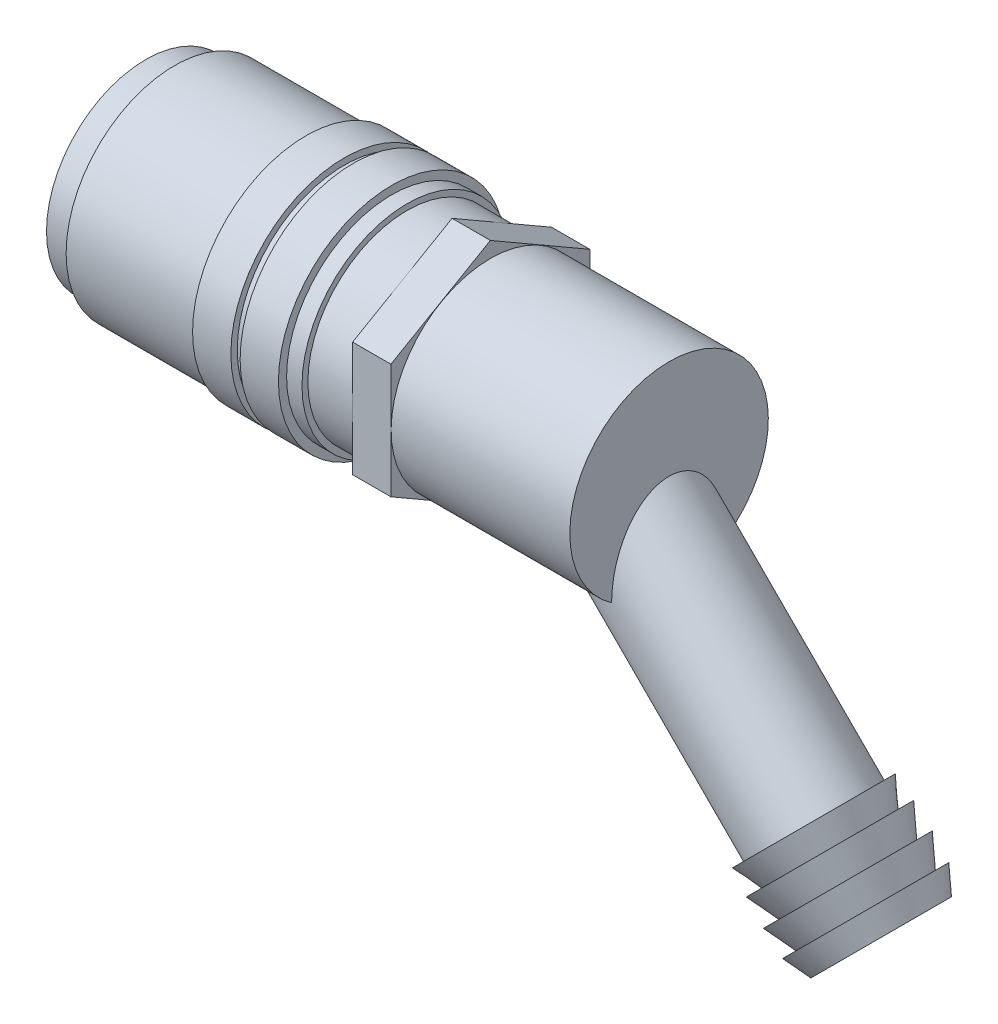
ISO-10303-21;
HEADER;
FILE_DESCRIPTION(('STEP AP214'),'2;1');
FILE_NAME('part.step','',(''),(''),'','','');
FILE_SCHEMA(('AUTOMOTIVE_DESIGN { 1 0 10303 214 1 1 1 1 }'));
ENDSEC;
DATA;
#1=APPLICATION_CONTEXT('core data for automotive mechanical design processes');
#2=APPLICATION_PROTOCOL_DEFINITION('international standard','automotive_design',2000,#1);
#3=PRODUCT_CONTEXT('',#1,'mechanical');
#4=PRODUCT('Part','Part','',(#3));
#5=PRODUCT_RELATED_PRODUCT_CATEGORY('part','',(#4));
#6=PRODUCT_DEFINITION_FORMATION('','',#4);
#7=PRODUCT_DEFINITION_CONTEXT('part definition',#1,'design');
#8=PRODUCT_DEFINITION('design','',#6,#7);
#9=PRODUCT_DEFINITION_SHAPE('','',#8);
#10=(LENGTH_UNIT() NAMED_UNIT(*) SI_UNIT(.MILLI.,.METRE.));
#11=(NAMED_UNIT(*) PLANE_ANGLE_UNIT() SI_UNIT($,.RADIAN.));
#12=(NAMED_UNIT(*) SI_UNIT($,.STERADIAN.) SOLID_ANGLE_UNIT());
#13=UNCERTAINTY_MEASURE_WITH_UNIT(LENGTH_MEASURE(1.E-05),#10,'distance_accuracy_value','');
#14=(GEOMETRIC_REPRESENTATION_CONTEXT(3) GLOBAL_UNCERTAINTY_ASSIGNED_CONTEXT((#13)) GLOBAL_UNIT_ASSIGNED_CONTEXT((#10,
#11,#12)) REPRESENTATION_CONTEXT('',''));
#15=CARTESIAN_POINT('',(0.,0.,0.));
#16=DIRECTION('',(0.,0.,1.));
#17=DIRECTION('',(1.,0.,0.));
#18=AXIS2_PLACEMENT_3D('',#15,#16,#17);
#19=CARTESIAN_POINT('',(41.,0.,0.));
#20=DIRECTION('',(-1.,0.,0.));
#21=DIRECTION('',(0.,0.,1.));
#22=AXIS2_PLACEMENT_3D('',#19,#20,#21);
#23=CYLINDRICAL_SURFACE('',#22,7.77632073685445);
#24=CARTESIAN_POINT('',(27.,0.,0.));
#25=DIRECTION('',(1.,0.,0.));
#26=DIRECTION('',(0.,0.,-1.));
#27=AXIS2_PLACEMENT_3D('',#24,#25,#26);
#28=CIRCLE('',#27,7.77632073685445);
#29=CARTESIAN_POINT('',(27.,0.,-7.77632073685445));
#30=VERTEX_POINT('',#29);
#31=EDGE_CURVE('E94',#30,#30,#28,.T.);
#32=ORIENTED_EDGE('',*,*,#31,.T.);
#33=EDGE_LOOP('',(#32));
#34=FACE_BOUND('',#33,.T.);
#35=CARTESIAN_POINT('',(41.,-6.34203473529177,4.49997329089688));
#36=CARTESIAN_POINT('',(40.8430959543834,-6.34174600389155,4.50032956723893));
#37=CARTESIAN_POINT('',(40.6860777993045,-6.34438767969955,4.49665247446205));
#38=CARTESIAN_POINT('',(40.3724233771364,-6.3561010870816,4.48010877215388));
#39=CARTESIAN_POINT('',(40.2157887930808,-6.36518744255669,4.46722126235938));
#40=CARTESIAN_POINT('',(39.9030597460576,-6.39046083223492,4.43098605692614));
#41=CARTESIAN_POINT('',(39.7469782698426,-6.40670091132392,4.40756019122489));
#42=CARTESIAN_POINT('',(39.4380870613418,-6.44660150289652,4.34899585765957));
#43=CARTESIAN_POINT('',(39.285274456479,-6.47025518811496,4.31386816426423));
#44=CARTESIAN_POINT('',(39.0193339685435,-6.51858889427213,4.24035470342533));
#45=CARTESIAN_POINT('',(38.9052021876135,-6.54176615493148,4.20460169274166));
#46=CARTESIAN_POINT('',(38.6806909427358,-6.59222412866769,4.12504151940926));
#47=CARTESIAN_POINT('',(38.5703115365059,-6.61950490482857,4.08123423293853));
#48=CARTESIAN_POINT('',(38.3546438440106,-6.67761478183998,3.98544196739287));
#49=CARTESIAN_POINT('',(38.2493380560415,-6.70843022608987,3.93348819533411));
#50=CARTESIAN_POINT('',(38.0442769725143,-6.77303928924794,3.82116437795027));
#51=CARTESIAN_POINT('',(37.9445212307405,-6.80683266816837,3.76079501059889));
#52=CARTESIAN_POINT('',(37.7509345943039,-6.87672556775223,3.6314232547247));
#53=CARTESIAN_POINT('',(37.6571317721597,-6.91283460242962,3.56238396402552));
#54=CARTESIAN_POINT('',(37.476616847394,-6.9862558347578,3.41615039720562));
#55=CARTESIAN_POINT('',(37.3899049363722,-7.02356806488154,3.33895590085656));
#56=CARTESIAN_POINT('',(37.2239843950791,-7.09841286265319,3.17674141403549));
#57=CARTESIAN_POINT('',(37.1447864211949,-7.1359456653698,3.09171063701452));
#58=CARTESIAN_POINT('',(36.9943993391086,-7.21013965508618,2.91449388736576));
#59=CARTESIAN_POINT('',(36.9232100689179,-7.24680085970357,2.82230805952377));
#60=CARTESIAN_POINT('',(36.7922511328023,-7.31656745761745,2.63598685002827));
#61=CARTESIAN_POINT('',(36.7321000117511,-7.3497590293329,2.54215125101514));
#62=CARTESIAN_POINT('',(36.6193554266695,-7.41368584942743,2.34920358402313));
#63=CARTESIAN_POINT('',(36.5667645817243,-7.44442024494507,2.25008970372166));
#64=CARTESIAN_POINT('',(36.4692389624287,-7.50270931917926,2.04734844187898));
#65=CARTESIAN_POINT('',(36.4242995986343,-7.5302659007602,1.94372381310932));
#66=CARTESIAN_POINT('',(36.3420258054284,-7.58163734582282,1.73255651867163));
#67=CARTESIAN_POINT('',(36.3046942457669,-7.60545079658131,1.62501239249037));
#68=CARTESIAN_POINT('',(36.2363495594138,-7.64966458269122,1.40254928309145));
#69=CARTESIAN_POINT('',(36.20563417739,-7.66989870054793,1.28750569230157));
#70=CARTESIAN_POINT('',(36.1523663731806,-7.70535823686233,1.0547434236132));
#71=CARTESIAN_POINT('',(36.1298169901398,-7.7205817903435,0.937023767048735));
#72=CARTESIAN_POINT('',(36.0928699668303,-7.74569005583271,0.699769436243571));
#73=CARTESIAN_POINT('',(36.0784710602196,-7.7555755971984,0.580235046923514));
#74=CARTESIAN_POINT('',(36.057794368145,-7.7698115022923,0.340097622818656));
#75=CARTESIAN_POINT('',(36.0515194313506,-7.77415992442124,0.219494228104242));
#76=CARTESIAN_POINT('',(36.0470312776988,-7.77726735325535,-0.0251322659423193));
#77=CARTESIAN_POINT('',(36.0490359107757,-7.77587532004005,-0.14916136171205));
#78=CARTESIAN_POINT('',(36.0616049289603,-7.76718826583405,-0.396577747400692));
#79=CARTESIAN_POINT('',(36.0721693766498,-7.75989320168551,-0.519965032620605));
#80=CARTESIAN_POINT('',(36.1018790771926,-7.73955414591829,-0.765254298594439));
#81=CARTESIAN_POINT('',(36.1210263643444,-7.726508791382,-0.887155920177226));
#82=CARTESIAN_POINT('',(36.1679224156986,-7.69495903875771,-1.12852926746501));
#83=CARTESIAN_POINT('',(36.1956680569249,-7.67645662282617,-1.24800185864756));
#84=CARTESIAN_POINT('',(36.2598771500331,-7.63435201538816,-1.48399296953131));
#85=CARTESIAN_POINT('',(36.2963622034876,-7.61073720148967,-1.60050336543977));
#86=CARTESIAN_POINT('',(36.3780261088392,-7.55899446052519,-1.8293505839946));
#87=CARTESIAN_POINT('',(36.4232015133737,-7.53086832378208,-1.94168904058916));
#88=CARTESIAN_POINT('',(36.5222899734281,-7.47076157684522,-2.16145087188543));
#89=CARTESIAN_POINT('',(36.5762077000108,-7.43877890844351,-2.26887157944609));
#90=CARTESIAN_POINT('',(36.6927030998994,-7.37179792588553,-2.47786104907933));
#91=CARTESIAN_POINT('',(36.7552770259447,-7.33680091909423,-2.57943231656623));
#92=CARTESIAN_POINT('',(36.8875626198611,-7.2654820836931,-2.77388374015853));
#93=CARTESIAN_POINT('',(36.9570934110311,-7.22920448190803,-2.866903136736));
#94=CARTESIAN_POINT('',(37.1041245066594,-7.1556232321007,-3.04591247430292));
#95=CARTESIAN_POINT('',(37.1816215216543,-7.11832001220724,-3.13190529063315));
#96=CARTESIAN_POINT('',(37.3441526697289,-7.04374955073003,-3.2961926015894));
#97=CARTESIAN_POINT('',(37.4291757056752,-7.00648233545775,-3.37449808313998));
#98=CARTESIAN_POINT('',(37.6063627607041,-6.93295712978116,-3.52308730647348));
#99=CARTESIAN_POINT('',(37.698526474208,-6.89669909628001,-3.59337139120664));
#100=CARTESIAN_POINT('',(37.8852630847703,-6.82767407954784,-3.72279206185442));
#101=CARTESIAN_POINT('',(37.9795644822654,-6.79482411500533,-3.7822767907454));
#102=CARTESIAN_POINT('',(38.1734308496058,-6.73169247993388,-3.89352972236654));
#103=CARTESIAN_POINT('',(38.2729960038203,-6.7014108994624,-3.9452976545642));
#104=CARTESIAN_POINT('',(38.4769882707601,-6.64392650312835,-4.04135536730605));
#105=CARTESIAN_POINT('',(38.5814317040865,-6.6167352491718,-4.08561735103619));
#106=CARTESIAN_POINT('',(38.794021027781,-6.56600467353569,-4.1666565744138));
#107=CARTESIAN_POINT('',(38.9021669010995,-6.54246533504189,-4.2034338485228));
#108=CARTESIAN_POINT('',(39.1708739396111,-6.48957298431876,-4.28485074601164));
#109=CARTESIAN_POINT('',(39.3330676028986,-6.46238928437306,-4.32555024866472));
#110=CARTESIAN_POINT('',(39.6615877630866,-6.41650087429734,-4.39332840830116));
#111=CARTESIAN_POINT('',(39.827919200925,-6.39780687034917,-4.42038987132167));
#112=CARTESIAN_POINT('',(40.1616948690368,-6.36870421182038,-4.4622252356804));
#113=CARTESIAN_POINT('',(40.3291253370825,-6.35824372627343,-4.47707603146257));
#114=CARTESIAN_POINT('',(40.6644220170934,-6.34476238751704,-4.49612258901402));
#115=CARTESIAN_POINT('',(40.8322855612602,-6.34172006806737,-4.50034909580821));
#116=CARTESIAN_POINT('',(41.,-6.34203473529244,-4.49997329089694));
#117=B_SPLINE_CURVE_WITH_KNOTS('',3,(#35,#36,#37,#38,#39,#40,#41,#42,#43,#44,#45,#46,#47,#48,
#49,#50,#51,#52,#53,#54,#55,#56,#57,#58,#59,#60,#61,#62,#63,#64,#65,#66,#67,#68,#69,#70,#71,#72,
#73,#74,#75,#76,#77,#78,#79,#80,#81,#82,#83,#84,#85,#86,#87,#88,#89,#90,#91,#92,#93,#94,#95,#96,
#97,#98,#99,#100,#101,#102,#103,#104,#105,#106,#107,#108,#109,#110,#111,#112,#113,#114,#115,
#116),.UNSPECIFIED.,.F.,.F.,(4,2,2,2,2,2,2,2,2,2,2,2,2,2,2,2,2,2,2,2,2,2,2,2,2,2,2,2,2,2,2,2,2,
2,2,2,2,2,2,2,4),(0.,0.470785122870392,0.942641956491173,1.41805810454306,1.89303771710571,
2.25815835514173,2.62328460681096,2.98704487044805,3.35077584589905,3.71611108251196,
4.08145618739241,4.44731191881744,4.81316024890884,5.1616586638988,5.51027751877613,
5.85868652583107,6.20722671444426,6.56915347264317,6.93121479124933,7.29321984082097,
7.6553517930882,8.0270719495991,8.39879482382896,8.77060585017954,9.14228199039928,
9.51488647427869,9.88734345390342,10.260000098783,10.6324959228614,10.9970403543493,
11.3614348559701,11.7253007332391,12.0891510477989,12.4374442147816,12.7857495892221,
13.1353179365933,13.4848846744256,13.9921820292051,14.50011736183,15.0048290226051,
15.508078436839),.UNSPECIFIED.);
#118=CARTESIAN_POINT('',(41.,-6.34203473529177,4.49997329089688));
#119=VERTEX_POINT('',#118);
#120=CARTESIAN_POINT('',(41.,-6.34203473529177,-4.49997329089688));
#121=VERTEX_POINT('',#120);
#122=EDGE_CURVE('E29',#119,#121,#117,.T.);
#123=ORIENTED_EDGE('',*,*,#122,.F.);
#124=CARTESIAN_POINT('',(41.,0.,0.));
#125=DIRECTION('',(1.,0.,0.));
#126=DIRECTION('',(0.,0.,-1.));
#127=AXIS2_PLACEMENT_3D('',#124,#125,#126);
#128=CIRCLE('',#127,7.77632073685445);
#129=EDGE_CURVE('E84',#121,#119,#128,.T.);
#130=ORIENTED_EDGE('',*,*,#129,.F.);
#131=EDGE_LOOP('',(#123,#130));
#132=FACE_BOUND('',#131,.T.);
#133=ADVANCED_FACE('F15',(#34,#132),#23,.T.);
#134=CARTESIAN_POINT('',(0.,0.,0.));
#135=DIRECTION('',(-1.,0.,0.));
#136=DIRECTION('',(0.,0.,1.));
#137=AXIS2_PLACEMENT_3D('',#134,#135,#136);
#138=CYLINDRICAL_SURFACE('',#137,7.77632073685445);
#139=CARTESIAN_POINT('',(0.,0.,0.));
#140=DIRECTION('',(-1.,0.,0.));
#141=DIRECTION('',(0.,0.,1.));
#142=AXIS2_PLACEMENT_3D('',#139,#140,#141);
#143=CIRCLE('',#142,7.77632073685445);
#144=CARTESIAN_POINT('',(0.,0.,7.77632073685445));
#145=VERTEX_POINT('',#144);
#146=EDGE_CURVE('E96',#145,#145,#143,.T.);
#147=ORIENTED_EDGE('',*,*,#146,.F.);
#148=EDGE_LOOP('',(#147));
#149=FACE_BOUND('',#148,.T.);
#150=CARTESIAN_POINT('',(2.26082941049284,0.,0.));
#151=DIRECTION('',(-1.,0.,0.));
#152=DIRECTION('',(0.,0.,1.));
#153=AXIS2_PLACEMENT_3D('',#150,#151,#152);
#154=CIRCLE('',#153,7.77632073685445);
#155=CARTESIAN_POINT('',(2.26082941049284,0.,7.77632073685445));
#156=VERTEX_POINT('',#155);
#157=EDGE_CURVE('E234',#156,#156,#154,.T.);
#158=ORIENTED_EDGE('',*,*,#157,.T.);
#159=EDGE_LOOP('',(#158));
#160=FACE_BOUND('',#159,.T.);
#161=ADVANCED_FACE('F17',(#149,#160),#138,.T.);
#162=CARTESIAN_POINT('',(0.,4.75,0.));
#163=DIRECTION('',(1.,0.,0.));
#164=DIRECTION('',(0.,0.,-1.));
#165=AXIS2_PLACEMENT_3D('',#162,#163,#164);
#166=PLANE('',#165);
#167=CARTESIAN_POINT('',(0.,0.,0.));
#168=DIRECTION('',(-1.,0.,0.));
#169=DIRECTION('',(0.,0.,1.));
#170=AXIS2_PLACEMENT_3D('',#167,#168,#169);
#171=CIRCLE('',#170,4.75);
#172=CARTESIAN_POINT('',(0.,0.,4.75));
#173=VERTEX_POINT('',#172);
#174=EDGE_CURVE('E270',#173,#173,#171,.T.);
#175=ORIENTED_EDGE('',*,*,#174,.F.);
#176=EDGE_LOOP('',(#175));
#177=FACE_BOUND('',#176,.T.);
#178=ORIENTED_EDGE('',*,*,#146,.T.);
#179=EDGE_LOOP('',(#178));
#180=FACE_BOUND('',#179,.T.);
#181=ADVANCED_FACE('F169',(#177,#180),#166,.F.);
#182=CARTESIAN_POINT('',(0.,0.,0.));
#183=DIRECTION('',(-1.,0.,0.));
#184=DIRECTION('',(0.,0.,1.));
#185=AXIS2_PLACEMENT_3D('',#182,#183,#184);
#186=CYLINDRICAL_SURFACE('',#185,4.75);
#187=ORIENTED_EDGE('',*,*,#174,.T.);
#188=EDGE_LOOP('',(#187));
#189=FACE_BOUND('',#188,.T.);
#190=CARTESIAN_POINT('',(27.,0.,0.));
#191=DIRECTION('',(1.,0.,0.));
#192=DIRECTION('',(0.,0.,-1.));
#193=AXIS2_PLACEMENT_3D('',#190,#191,#192);
#194=CIRCLE('',#193,4.75);
#195=CARTESIAN_POINT('',(27.,0.,-4.75));
#196=VERTEX_POINT('',#195);
#197=EDGE_CURVE('E182',#196,#196,#194,.T.);
#198=ORIENTED_EDGE('',*,*,#197,.T.);
#199=EDGE_LOOP('',(#198));
#200=FACE_BOUND('',#199,.T.);
#201=ADVANCED_FACE('F351',(#189,#200),#186,.F.);
#202=CARTESIAN_POINT('',(0.,0.,0.));
#203=DIRECTION('',(-1.,0.,0.));
#204=DIRECTION('',(0.,0.,1.));
#205=AXIS2_PLACEMENT_3D('',#202,#203,#204);
#206=CYLINDRICAL_SURFACE('',#205,7.77632073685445);
#207=CARTESIAN_POINT('',(20.4767230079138,0.,0.));
#208=DIRECTION('',(-1.,0.,0.));
#209=DIRECTION('',(0.,0.,1.));
#210=AXIS2_PLACEMENT_3D('',#207,#208,#209);
#211=CIRCLE('',#210,7.77632073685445);
#212=CARTESIAN_POINT('',(20.4767230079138,0.,7.77632073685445));
#213=VERTEX_POINT('',#212);
#214=EDGE_CURVE('E267',#213,#213,#211,.T.);
#215=ORIENTED_EDGE('',*,*,#214,.F.);
#216=EDGE_LOOP('',(#215));
#217=FACE_BOUND('',#216,.T.);
#218=CARTESIAN_POINT('',(24.,0.,0.));
#219=DIRECTION('',(-1.,0.,0.));
#220=DIRECTION('',(0.,0.,1.));
#221=AXIS2_PLACEMENT_3D('',#218,#219,#220);
#222=CIRCLE('',#221,7.77632073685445);
#223=CARTESIAN_POINT('',(24.,0.,7.77632073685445));
#224=VERTEX_POINT('',#223);
#225=EDGE_CURVE('E233',#224,#224,#222,.T.);
#226=ORIENTED_EDGE('',*,*,#225,.T.);
#227=EDGE_LOOP('',(#226));
#228=FACE_BOUND('',#227,.T.);
#229=ADVANCED_FACE('F345',(#217,#228),#206,.T.);
#230=CARTESIAN_POINT('',(20.4767230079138,8.23838165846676,0.));
#231=DIRECTION('',(-1.,0.,0.));
#232=DIRECTION('',(0.,0.,1.));
#233=AXIS2_PLACEMENT_3D('',#230,#231,#232);
#234=PLANE('',#233);
#235=CARTESIAN_POINT('',(20.4767230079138,0.,0.));
#236=DIRECTION('',(-1.,0.,0.));
#237=DIRECTION('',(0.,0.,1.));
#238=AXIS2_PLACEMENT_3D('',#235,#236,#237);
#239=CIRCLE('',#238,8.23838165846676);
#240=CARTESIAN_POINT('',(20.4767230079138,0.,8.23838165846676));
#241=VERTEX_POINT('',#240);
#242=EDGE_CURVE('E264',#241,#241,#239,.T.);
#243=ORIENTED_EDGE('',*,*,#242,.F.);
#244=EDGE_LOOP('',(#243));
#245=FACE_BOUND('',#244,.T.);
#246=ORIENTED_EDGE('',*,*,#214,.T.);
#247=EDGE_LOOP('',(#246));
#248=FACE_BOUND('',#247,.T.);
#249=ADVANCED_FACE('F339',(#245,#248),#234,.F.);
#250=CARTESIAN_POINT('',(0.,0.,0.));
#251=DIRECTION('',(-1.,0.,0.));
#252=DIRECTION('',(0.,0.,1.));
#253=AXIS2_PLACEMENT_3D('',#250,#251,#252);
#254=CYLINDRICAL_SURFACE('',#253,8.23838165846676);
#255=CARTESIAN_POINT('',(19.2715238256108,0.,0.));
#256=DIRECTION('',(-1.,0.,0.));
#257=DIRECTION('',(0.,0.,1.));
#258=AXIS2_PLACEMENT_3D('',#255,#256,#257);
#259=CIRCLE('',#258,8.23838165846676);
#260=CARTESIAN_POINT('',(19.2715238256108,0.,8.23838165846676));
#261=VERTEX_POINT('',#260);
#262=EDGE_CURVE('E261',#261,#261,#259,.T.);
#263=ORIENTED_EDGE('',*,*,#262,.F.);
#264=EDGE_LOOP('',(#263));
#265=FACE_BOUND('',#264,.T.);
#266=ORIENTED_EDGE('',*,*,#242,.T.);
#267=EDGE_LOOP('',(#266));
#268=FACE_BOUND('',#267,.T.);
#269=ADVANCED_FACE('F333',(#265,#268),#254,.T.);
#270=CARTESIAN_POINT('',(19.2715238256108,8.8782970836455,0.));
#271=DIRECTION('',(-1.,0.,0.));
#272=DIRECTION('',(0.,0.,1.));
#273=AXIS2_PLACEMENT_3D('',#270,#271,#272);
#274=PLANE('',#273);
#275=CARTESIAN_POINT('',(19.2715238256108,0.,0.));
#276=DIRECTION('',(-1.,0.,0.));
#277=DIRECTION('',(0.,0.,1.));
#278=AXIS2_PLACEMENT_3D('',#275,#276,#277);
#279=CIRCLE('',#278,8.8782970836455);
#280=CARTESIAN_POINT('',(19.2715238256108,0.,8.8782970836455));
#281=VERTEX_POINT('',#280);
#282=EDGE_CURVE('E258',#281,#281,#279,.T.);
#283=ORIENTED_EDGE('',*,*,#282,.F.);
#284=EDGE_LOOP('',(#283));
#285=FACE_BOUND('',#284,.T.);
#286=ORIENTED_EDGE('',*,*,#262,.T.);
#287=EDGE_LOOP('',(#286));
#288=FACE_BOUND('',#287,.T.);
#289=ADVANCED_FACE('F327',(#285,#288),#274,.F.);
#290=CARTESIAN_POINT('',(0.,0.,0.));
#291=DIRECTION('',(-1.,0.,0.));
#292=DIRECTION('',(0.,0.,1.));
#293=AXIS2_PLACEMENT_3D('',#290,#291,#292);
#294=CYLINDRICAL_SURFACE('',#293,8.8782970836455);
#295=CARTESIAN_POINT('',(16.2715238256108,0.,0.));
#296=DIRECTION('',(-1.,0.,0.));
#297=DIRECTION('',(0.,0.,1.));
#298=AXIS2_PLACEMENT_3D('',#295,#296,#297);
#299=CIRCLE('',#298,8.8782970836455);
#300=CARTESIAN_POINT('',(16.2715238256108,0.,8.8782970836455));
#301=VERTEX_POINT('',#300);
#302=EDGE_CURVE('E255',#301,#301,#299,.T.);
#303=ORIENTED_EDGE('',*,*,#302,.F.);
#304=EDGE_LOOP('',(#303));
#305=FACE_BOUND('',#304,.T.);
#306=ORIENTED_EDGE('',*,*,#282,.T.);
#307=EDGE_LOOP('',(#306));
#308=FACE_BOUND('',#307,.T.);
#309=ADVANCED_FACE('F321',(#305,#308),#294,.T.);
#310=CARTESIAN_POINT('',(16.2715238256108,8.3782970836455,0.));
#311=DIRECTION('',(1.,0.,0.));
#312=DIRECTION('',(0.,0.,-1.));
#313=AXIS2_PLACEMENT_3D('',#310,#311,#312);
#314=PLANE('',#313);
#315=CARTESIAN_POINT('',(16.2715238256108,0.,0.));
#316=DIRECTION('',(-1.,0.,0.));
#317=DIRECTION('',(0.,0.,1.));
#318=AXIS2_PLACEMENT_3D('',#315,#316,#317);
#319=CIRCLE('',#318,8.3782970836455);
#320=CARTESIAN_POINT('',(16.2715238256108,0.,8.3782970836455));
#321=VERTEX_POINT('',#320);
#322=EDGE_CURVE('E252',#321,#321,#319,.T.);
#323=ORIENTED_EDGE('',*,*,#322,.F.);
#324=EDGE_LOOP('',(#323));
#325=FACE_BOUND('',#324,.T.);
#326=ORIENTED_EDGE('',*,*,#302,.T.);
#327=EDGE_LOOP('',(#326));
#328=FACE_BOUND('',#327,.T.);
#329=ADVANCED_FACE('F315',(#325,#328),#314,.F.);
#330=CARTESIAN_POINT('',(0.,0.,0.));
#331=DIRECTION('',(-1.,0.,0.));
#332=DIRECTION('',(0.,0.,1.));
#333=AXIS2_PLACEMENT_3D('',#330,#331,#332);
#334=CYLINDRICAL_SURFACE('',#333,8.3782970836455);
#335=CARTESIAN_POINT('',(15.5455682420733,0.,0.));
#336=DIRECTION('',(-1.,0.,0.));
#337=DIRECTION('',(0.,0.,1.));
#338=AXIS2_PLACEMENT_3D('',#335,#336,#337);
#339=CIRCLE('',#338,8.3782970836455);
#340=CARTESIAN_POINT('',(15.5455682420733,0.,8.3782970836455));
#341=VERTEX_POINT('',#340);
#342=EDGE_CURVE('E249',#341,#341,#339,.T.);
#343=ORIENTED_EDGE('',*,*,#342,.F.);
#344=EDGE_LOOP('',(#343));
#345=FACE_BOUND('',#344,.T.);
#346=ORIENTED_EDGE('',*,*,#322,.T.);
#347=EDGE_LOOP('',(#346));
#348=FACE_BOUND('',#347,.T.);
#349=ADVANCED_FACE('F309',(#345,#348),#334,.T.);
#350=CARTESIAN_POINT('',(15.5455682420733,8.8782970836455,0.));
#351=DIRECTION('',(-1.,0.,0.));
#352=DIRECTION('',(0.,0.,1.));
#353=AXIS2_PLACEMENT_3D('',#350,#351,#352);
#354=PLANE('',#353);
#355=CARTESIAN_POINT('',(15.5455682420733,0.,0.));
#356=DIRECTION('',(-1.,0.,0.));
#357=DIRECTION('',(0.,0.,1.));
#358=AXIS2_PLACEMENT_3D('',#355,#356,#357);
#359=CIRCLE('',#358,8.8782970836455);
#360=CARTESIAN_POINT('',(15.5455682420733,0.,8.8782970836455));
#361=VERTEX_POINT('',#360);
#362=EDGE_CURVE('E246',#361,#361,#359,.T.);
#363=ORIENTED_EDGE('',*,*,#362,.F.);
#364=EDGE_LOOP('',(#363));
#365=FACE_BOUND('',#364,.T.);
#366=ORIENTED_EDGE('',*,*,#342,.T.);
#367=EDGE_LOOP('',(#366));
#368=FACE_BOUND('',#367,.T.);
#369=ADVANCED_FACE('F303',(#365,#368),#354,.F.);
#370=CARTESIAN_POINT('',(0.,0.,0.));
#371=DIRECTION('',(-1.,0.,0.));
#372=DIRECTION('',(0.,0.,1.));
#373=AXIS2_PLACEMENT_3D('',#370,#371,#372);
#374=CYLINDRICAL_SURFACE('',#373,8.8782970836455);
#375=CARTESIAN_POINT('',(12.5455682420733,0.,0.));
#376=DIRECTION('',(-1.,0.,0.));
#377=DIRECTION('',(0.,0.,1.));
#378=AXIS2_PLACEMENT_3D('',#375,#376,#377);
#379=CIRCLE('',#378,8.8782970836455);
#380=CARTESIAN_POINT('',(12.5455682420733,0.,8.8782970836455));
#381=VERTEX_POINT('',#380);
#382=EDGE_CURVE('E243',#381,#381,#379,.T.);
#383=ORIENTED_EDGE('',*,*,#382,.F.);
#384=EDGE_LOOP('',(#383));
#385=FACE_BOUND('',#384,.T.);
#386=ORIENTED_EDGE('',*,*,#362,.T.);
#387=EDGE_LOOP('',(#386));
#388=FACE_BOUND('',#387,.T.);
#389=ADVANCED_FACE('F297',(#385,#388),#374,.T.);
#390=CARTESIAN_POINT('',(12.5455682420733,8.5,0.));
#391=DIRECTION('',(1.,0.,0.));
#392=DIRECTION('',(0.,0.,-1.));
#393=AXIS2_PLACEMENT_3D('',#390,#391,#392);
#394=PLANE('',#393);
#395=CARTESIAN_POINT('',(12.5455682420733,0.,0.));
#396=DIRECTION('',(-1.,0.,0.));
#397=DIRECTION('',(0.,0.,1.));
#398=AXIS2_PLACEMENT_3D('',#395,#396,#397);
#399=CIRCLE('',#398,8.5);
#400=CARTESIAN_POINT('',(12.5455682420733,0.,8.5));
#401=VERTEX_POINT('',#400);
#402=EDGE_CURVE('E240',#401,#401,#399,.T.);
#403=ORIENTED_EDGE('',*,*,#402,.F.);
#404=EDGE_LOOP('',(#403));
#405=FACE_BOUND('',#404,.T.);
#406=ORIENTED_EDGE('',*,*,#382,.T.);
#407=EDGE_LOOP('',(#406));
#408=FACE_BOUND('',#407,.T.);
#409=ADVANCED_FACE('F291',(#405,#408),#394,.F.);
#410=CARTESIAN_POINT('',(0.,0.,0.));
#411=DIRECTION('',(-1.,0.,0.));
#412=DIRECTION('',(0.,0.,1.));
#413=AXIS2_PLACEMENT_3D('',#410,#411,#412);
#414=CYLINDRICAL_SURFACE('',#413,8.5);
#415=CARTESIAN_POINT('',(2.26082941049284,0.,0.));
#416=DIRECTION('',(-1.,0.,0.));
#417=DIRECTION('',(0.,0.,1.));
#418=AXIS2_PLACEMENT_3D('',#415,#416,#417);
#419=CIRCLE('',#418,8.5);
#420=CARTESIAN_POINT('',(2.26082941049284,0.,8.5));
#421=VERTEX_POINT('',#420);
#422=EDGE_CURVE('E237',#421,#421,#419,.T.);
#423=ORIENTED_EDGE('',*,*,#422,.F.);
#424=EDGE_LOOP('',(#423));
#425=FACE_BOUND('',#424,.T.);
#426=ORIENTED_EDGE('',*,*,#402,.T.);
#427=EDGE_LOOP('',(#426));
#428=FACE_BOUND('',#427,.T.);
#429=ADVANCED_FACE('F285',(#425,#428),#414,.T.);
#430=CARTESIAN_POINT('',(2.26082941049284,7.77632073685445,0.));
#431=DIRECTION('',(1.,0.,0.));
#432=DIRECTION('',(0.,0.,-1.));
#433=AXIS2_PLACEMENT_3D('',#430,#431,#432);
#434=PLANE('',#433);
#435=ORIENTED_EDGE('',*,*,#157,.F.);
#436=EDGE_LOOP('',(#435));
#437=FACE_BOUND('',#436,.T.);
#438=ORIENTED_EDGE('',*,*,#422,.T.);
#439=EDGE_LOOP('',(#438));
#440=FACE_BOUND('',#439,.T.);
#441=ADVANCED_FACE('F281',(#437,#440),#434,.F.);
#442=CARTESIAN_POINT('',(27.,0.,0.));
#443=DIRECTION('',(1.,0.,0.));
#444=DIRECTION('',(0.,0.,-1.));
#445=AXIS2_PLACEMENT_3D('',#442,#443,#444);
#446=PLANE('',#445);
#447=ORIENTED_EDGE('',*,*,#31,.F.);
#448=EDGE_LOOP('',(#447));
#449=FACE_BOUND('',#448,.T.);
#450=DIRECTION('',(0.,0.5,0.866025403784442));
#451=VECTOR('',#450,1.);
#452=CARTESIAN_POINT('',(27.,4.50000000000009,-7.7942286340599));
#453=LINE('',#452,#451);
#454=CARTESIAN_POINT('',(27.,4.50000000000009,-7.7942286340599));
#455=VERTEX_POINT('',#454);
#456=CARTESIAN_POINT('',(27.,9.,0.));
#457=VERTEX_POINT('',#456);
#458=EDGE_CURVE('E190',#455,#457,#453,.T.);
#459=ORIENTED_EDGE('',*,*,#458,.T.);
#460=DIRECTION('',(0.,-0.5,0.866025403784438));
#461=VECTOR('',#460,1.);
#462=CARTESIAN_POINT('',(27.,9.,0.));
#463=LINE('',#462,#461);
#464=CARTESIAN_POINT('',(27.,4.5,7.79422863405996));
#465=VERTEX_POINT('',#464);
#466=EDGE_CURVE('E193',#457,#465,#463,.T.);
#467=ORIENTED_EDGE('',*,*,#466,.T.);
#468=DIRECTION('',(0.,-1.,0.));
#469=VECTOR('',#468,1.);
#470=CARTESIAN_POINT('',(27.,4.5,7.79422863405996));
#471=LINE('',#470,#469);
#472=CARTESIAN_POINT('',(27.,-4.5,7.79422863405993));
#473=VERTEX_POINT('',#472);
#474=EDGE_CURVE('E196',#465,#473,#471,.T.);
#475=ORIENTED_EDGE('',*,*,#474,.T.);
#476=DIRECTION('',(0.,-0.5,-0.866025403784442));
#477=VECTOR('',#476,1.);
#478=CARTESIAN_POINT('',(27.,-4.5,7.79422863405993));
#479=LINE('',#478,#477);
#480=CARTESIAN_POINT('',(27.,-9.,0.));
#481=VERTEX_POINT('',#480);
#482=EDGE_CURVE('E198',#473,#481,#479,.T.);
#483=ORIENTED_EDGE('',*,*,#482,.T.);
#484=DIRECTION('',(0.,0.500000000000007,-0.866025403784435));
#485=VECTOR('',#484,1.);
#486=CARTESIAN_POINT('',(27.,-9.,0.));
#487=LINE('',#486,#485);
#488=CARTESIAN_POINT('',(27.,-4.49999999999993,-7.79422863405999));
#489=VERTEX_POINT('',#488);
#490=EDGE_CURVE('E200',#481,#489,#487,.T.);
#491=ORIENTED_EDGE('',*,*,#490,.T.);
#492=DIRECTION('',(0.,1.,0.));
#493=VECTOR('',#492,1.);
#494=CARTESIAN_POINT('',(27.,-4.49999999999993,-7.79422863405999));
#495=LINE('',#494,#493);
#496=EDGE_CURVE('E202',#489,#455,#495,.T.);
#497=ORIENTED_EDGE('',*,*,#496,.T.);
#498=EDGE_LOOP('',(#459,#467,#475,#483,#491,#497));
#499=FACE_BOUND('',#498,.T.);
#500=ADVANCED_FACE('F284',(#449,#499),#446,.T.);
#501=CARTESIAN_POINT('',(24.,0.,0.));
#502=DIRECTION('',(1.,0.,0.));
#503=DIRECTION('',(0.,0.,-1.));
#504=AXIS2_PLACEMENT_3D('',#501,#502,#503);
#505=PLANE('',#504);
#506=ORIENTED_EDGE('',*,*,#225,.F.);
#507=EDGE_LOOP('',(#506));
#508=FACE_BOUND('',#507,.T.);
#509=DIRECTION('',(0.,0.5,0.866025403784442));
#510=VECTOR('',#509,1.);
#511=CARTESIAN_POINT('',(24.,4.50000000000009,-7.7942286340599));
#512=LINE('',#511,#510);
#513=CARTESIAN_POINT('',(24.,4.50000000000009,-7.7942286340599));
#514=VERTEX_POINT('',#513);
#515=CARTESIAN_POINT('',(24.,9.,0.));
#516=VERTEX_POINT('',#515);
#517=EDGE_CURVE('E189',#514,#516,#512,.T.);
#518=ORIENTED_EDGE('',*,*,#517,.F.);
#519=DIRECTION('',(0.,1.,0.));
#520=VECTOR('',#519,1.);
#521=CARTESIAN_POINT('',(24.,-4.49999999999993,-7.79422863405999));
#522=LINE('',#521,#520);
#523=CARTESIAN_POINT('',(24.,-4.49999999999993,-7.79422863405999));
#524=VERTEX_POINT('',#523);
#525=EDGE_CURVE('E194',#524,#514,#522,.T.);
#526=ORIENTED_EDGE('',*,*,#525,.F.);
#527=DIRECTION('',(0.,0.500000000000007,-0.866025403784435));
#528=VECTOR('',#527,1.);
#529=CARTESIAN_POINT('',(24.,-9.,0.));
#530=LINE('',#529,#528);
#531=CARTESIAN_POINT('',(24.,-9.,0.));
#532=VERTEX_POINT('',#531);
#533=EDGE_CURVE('E213',#532,#524,#530,.T.);
#534=ORIENTED_EDGE('',*,*,#533,.F.);
#535=DIRECTION('',(0.,-0.5,-0.866025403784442));
#536=VECTOR('',#535,1.);
#537=CARTESIAN_POINT('',(24.,-4.5,7.79422863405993));
#538=LINE('',#537,#536);
#539=CARTESIAN_POINT('',(24.,-4.5,7.79422863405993));
#540=VERTEX_POINT('',#539);
#541=EDGE_CURVE('E211',#540,#532,#538,.T.);
#542=ORIENTED_EDGE('',*,*,#541,.F.);
#543=DIRECTION('',(0.,-1.,0.));
#544=VECTOR('',#543,1.);
#545=CARTESIAN_POINT('',(24.,4.5,7.79422863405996));
#546=LINE('',#545,#544);
#547=CARTESIAN_POINT('',(24.,4.5,7.79422863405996));
#548=VERTEX_POINT('',#547);
#549=EDGE_CURVE('E209',#548,#540,#546,.T.);
#550=ORIENTED_EDGE('',*,*,#549,.F.);
#551=DIRECTION('',(0.,-0.5,0.866025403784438));
#552=VECTOR('',#551,1.);
#553=CARTESIAN_POINT('',(24.,9.,0.));
#554=LINE('',#553,#552);
#555=EDGE_CURVE('E207',#516,#548,#554,.T.);
#556=ORIENTED_EDGE('',*,*,#555,.F.);
#557=EDGE_LOOP('',(#518,#526,#534,#542,#550,#556));
#558=FACE_BOUND('',#557,.T.);
#559=ADVANCED_FACE('F355',(#508,#558),#505,.F.);
#560=CARTESIAN_POINT('',(27.,4.50000000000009,-7.7942286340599));
#561=DIRECTION('',(0.,-0.866025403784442,0.5));
#562=DIRECTION('',(0.,-0.5,-0.866025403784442));
#563=AXIS2_PLACEMENT_3D('',#560,#561,#562);
#564=PLANE('',#563);
#565=ORIENTED_EDGE('',*,*,#517,.T.);
#566=DIRECTION('',(-1.,0.,0.));
#567=VECTOR('',#566,1.);
#568=CARTESIAN_POINT('',(27.,9.,0.));
#569=LINE('',#568,#567);
#570=EDGE_CURVE('E230',#457,#516,#569,.T.);
#571=ORIENTED_EDGE('',*,*,#570,.F.);
#572=ORIENTED_EDGE('',*,*,#458,.F.);
#573=DIRECTION('',(-1.,0.,0.));
#574=VECTOR('',#573,1.);
#575=CARTESIAN_POINT('',(27.,4.50000000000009,-7.7942286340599));
#576=LINE('',#575,#574);
#577=EDGE_CURVE('E204',#455,#514,#576,.T.);
#578=ORIENTED_EDGE('',*,*,#577,.T.);
#579=EDGE_LOOP('',(#565,#571,#572,#578));
#580=FACE_BOUND('',#579,.T.);
#581=ADVANCED_FACE('F358',(#580),#564,.F.);
#582=CARTESIAN_POINT('',(27.,9.,0.));
#583=DIRECTION('',(0.,-0.866025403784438,-0.5));
#584=DIRECTION('',(0.,0.5,-0.866025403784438));
#585=AXIS2_PLACEMENT_3D('',#582,#583,#584);
#586=PLANE('',#585);
#587=ORIENTED_EDGE('',*,*,#555,.T.);
#588=DIRECTION('',(-1.,0.,0.));
#589=VECTOR('',#588,1.);
#590=CARTESIAN_POINT('',(27.,4.5,7.79422863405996));
#591=LINE('',#590,#589);
#592=EDGE_CURVE('E227',#465,#548,#591,.T.);
#593=ORIENTED_EDGE('',*,*,#592,.F.);
#594=ORIENTED_EDGE('',*,*,#466,.F.);
#595=ORIENTED_EDGE('',*,*,#570,.T.);
#596=EDGE_LOOP('',(#587,#593,#594,#595));
#597=FACE_BOUND('',#596,.T.);
#598=ADVANCED_FACE('F385',(#597),#586,.F.);
#599=CARTESIAN_POINT('',(27.,4.5,7.79422863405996));
#600=DIRECTION('',(0.,0.,-1.));
#601=DIRECTION('',(0.,1.,0.));
#602=AXIS2_PLACEMENT_3D('',#599,#600,#601);
#603=PLANE('',#602);
#604=ORIENTED_EDGE('',*,*,#549,.T.);
#605=DIRECTION('',(-1.,0.,0.));
#606=VECTOR('',#605,1.);
#607=CARTESIAN_POINT('',(27.,-4.5,7.79422863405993));
#608=LINE('',#607,#606);
#609=EDGE_CURVE('E224',#473,#540,#608,.T.);
#610=ORIENTED_EDGE('',*,*,#609,.F.);
#611=ORIENTED_EDGE('',*,*,#474,.F.);
#612=ORIENTED_EDGE('',*,*,#592,.T.);
#613=EDGE_LOOP('',(#604,#610,#611,#612));
#614=FACE_BOUND('',#613,.T.);
#615=ADVANCED_FACE('F382',(#614),#603,.F.);
#616=CARTESIAN_POINT('',(27.,-4.5,7.79422863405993));
#617=DIRECTION('',(0.,0.866025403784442,-0.5));
#618=DIRECTION('',(0.,0.5,0.866025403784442));
#619=AXIS2_PLACEMENT_3D('',#616,#617,#618);
#620=PLANE('',#619);
#621=ORIENTED_EDGE('',*,*,#541,.T.);
#622=DIRECTION('',(-1.,0.,0.));
#623=VECTOR('',#622,1.);
#624=CARTESIAN_POINT('',(27.,-9.,0.));
#625=LINE('',#624,#623);
#626=EDGE_CURVE('E221',#481,#532,#625,.T.);
#627=ORIENTED_EDGE('',*,*,#626,.F.);
#628=ORIENTED_EDGE('',*,*,#482,.F.);
#629=ORIENTED_EDGE('',*,*,#609,.T.);
#630=EDGE_LOOP('',(#621,#627,#628,#629));
#631=FACE_BOUND('',#630,.T.);
#632=ADVANCED_FACE('F377',(#631),#620,.F.);
#633=CARTESIAN_POINT('',(27.,-9.,0.));
#634=DIRECTION('',(0.,0.866025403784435,0.500000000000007));
#635=DIRECTION('',(0.,-0.500000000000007,0.866025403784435));
#636=AXIS2_PLACEMENT_3D('',#633,#634,#635);
#637=PLANE('',#636);
#638=ORIENTED_EDGE('',*,*,#533,.T.);
#639=DIRECTION('',(-1.,0.,0.));
#640=VECTOR('',#639,1.);
#641=CARTESIAN_POINT('',(27.,-4.49999999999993,-7.79422863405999));
#642=LINE('',#641,#640);
#643=EDGE_CURVE('E218',#489,#524,#642,.T.);
#644=ORIENTED_EDGE('',*,*,#643,.F.);
#645=ORIENTED_EDGE('',*,*,#490,.F.);
#646=ORIENTED_EDGE('',*,*,#626,.T.);
#647=EDGE_LOOP('',(#638,#644,#645,#646));
#648=FACE_BOUND('',#647,.T.);
#649=ADVANCED_FACE('F373',(#648),#637,.F.);
#650=CARTESIAN_POINT('',(27.,-4.49999999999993,-7.79422863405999));
#651=DIRECTION('',(0.,0.,1.));
#652=DIRECTION('',(0.,-1.,0.));
#653=AXIS2_PLACEMENT_3D('',#650,#651,#652);
#654=PLANE('',#653);
#655=ORIENTED_EDGE('',*,*,#525,.T.);
#656=ORIENTED_EDGE('',*,*,#577,.F.);
#657=ORIENTED_EDGE('',*,*,#496,.F.);
#658=ORIENTED_EDGE('',*,*,#643,.T.);
#659=EDGE_LOOP('',(#655,#656,#657,#658));
#660=FACE_BOUND('',#659,.T.);
#661=ADVANCED_FACE('F154',(#660),#654,.F.);
#662=CARTESIAN_POINT('',(41.,0.,0.));
#663=DIRECTION('',(1.,0.,0.));
#664=DIRECTION('',(0.,0.,-1.));
#665=AXIS2_PLACEMENT_3D('',#662,#663,#664);
#666=PLANE('',#665);
#667=ORIENTED_EDGE('',*,*,#129,.T.);
#668=CARTESIAN_POINT('',(41.,-6.36396103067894,0.));
#669=DIRECTION('',(1.,0.,0.));
#670=DIRECTION('',(0.,1.,0.));
#671=AXIS2_PLACEMENT_3D('',#668,#669,#670);
#672=ELLIPSE('',#671,6.36396103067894,4.5);
#673=EDGE_CURVE('E40',#119,#121,#672,.F.);
#674=ORIENTED_EDGE('',*,*,#673,.T.);
#675=EDGE_LOOP('',(#667,#674));
#676=FACE_BOUND('',#675,.T.);
#677=ADVANCED_FACE('F89',(#676),#666,.T.);
#678=CARTESIAN_POINT('',(27.,0.,0.));
#679=DIRECTION('',(1.,0.,0.));
#680=DIRECTION('',(0.,0.,-1.));
#681=AXIS2_PLACEMENT_3D('',#678,#679,#680);
#682=PLANE('',#681);
#683=ORIENTED_EDGE('',*,*,#197,.F.);
#684=EDGE_LOOP('',(#683));
#685=FACE_BOUND('',#684,.T.);
#686=ADVANCED_FACE('F151',(#685),#682,.F.);
#687=CARTESIAN_POINT('',(37.8180194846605,-3.18198051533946,0.));
#688=DIRECTION('',(-0.707106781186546,0.707106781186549,0.));
#689=DIRECTION('',(-0.707106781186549,-0.707106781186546,0.));
#690=AXIS2_PLACEMENT_3D('',#687,#688,#689);
#691=CYLINDRICAL_SURFACE('',#690,3.);
#692=CARTESIAN_POINT('',(41.,-6.36396103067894,0.));
#693=DIRECTION('',(1.,0.,0.));
#694=DIRECTION('',(0.,1.,0.));
#695=AXIS2_PLACEMENT_3D('',#692,#693,#694);
#696=ELLIPSE('',#695,4.24264068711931,3.);
#697=CARTESIAN_POINT('',(41.,-7.19857296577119,-2.94137917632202));
#698=VERTEX_POINT('',#697);
#699=CARTESIAN_POINT('',(41.,-7.19857296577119,2.94137917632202));
#700=VERTEX_POINT('',#699);
#701=EDGE_CURVE('E87',#698,#700,#696,.T.);
#702=ORIENTED_EDGE('',*,*,#701,.F.);
#703=CARTESIAN_POINT('',(41.,-7.19857296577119,-2.94137917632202));
#704=CARTESIAN_POINT('',(40.8946207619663,-7.2050421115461,-2.92550521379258));
#705=CARTESIAN_POINT('',(40.7897935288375,-7.21288274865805,-2.90620576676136));
#706=CARTESIAN_POINT('',(40.5818457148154,-7.23125729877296,-2.86020345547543));
#707=CARTESIAN_POINT('',(40.478728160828,-7.24179553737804,-2.83348869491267));
#708=CARTESIAN_POINT('',(40.2745505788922,-7.265563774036,-2.77197136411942));
#709=CARTESIAN_POINT('',(40.1735061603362,-7.27880919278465,-2.737122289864));
#710=CARTESIAN_POINT('',(39.9751686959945,-7.30770514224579,-2.65901117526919));
#711=CARTESIAN_POINT('',(39.8778732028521,-7.32335406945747,-2.61575473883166));
#712=CARTESIAN_POINT('',(39.6299408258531,-7.36691228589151,-2.49127157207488));
#713=CARTESIAN_POINT('',(39.4830211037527,-7.39647201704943,-2.40299041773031));
#714=CARTESIAN_POINT('',(39.2068868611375,-7.45832366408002,-2.20349441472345));
#715=CARTESIAN_POINT('',(39.0776230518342,-7.49060754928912,-2.09234567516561));
#716=CARTESIAN_POINT('',(38.8403883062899,-7.55467347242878,-1.84772738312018));
#717=CARTESIAN_POINT('',(38.7325423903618,-7.58645162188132,-1.71413472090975));
#718=CARTESIAN_POINT('',(38.5430445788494,-7.64539230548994,-1.42840999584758));
#719=CARTESIAN_POINT('',(38.4614086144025,-7.67255202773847,-1.27626673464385));
#720=CARTESIAN_POINT('',(38.3329545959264,-7.71670605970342,-0.972194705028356));
#721=CARTESIAN_POINT('',(38.283751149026,-7.73437235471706,-0.821366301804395));
#722=CARTESIAN_POINT('',(38.2108294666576,-7.76092423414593,-0.512965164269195));
#723=CARTESIAN_POINT('',(38.1871009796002,-7.76981335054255,-0.355395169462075));
#724=CARTESIAN_POINT('',(38.1659605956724,-7.77772420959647,-0.0430447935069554));
#725=CARTESIAN_POINT('',(38.167778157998,-7.77703487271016,0.1116768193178));
#726=CARTESIAN_POINT('',(38.1958187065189,-7.76656482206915,0.41857344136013));
#727=CARTESIAN_POINT('',(38.2220399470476,-7.75678475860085,0.57074863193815));
#728=CARTESIAN_POINT('',(38.298198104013,-7.72919165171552,0.867719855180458));
#729=CARTESIAN_POINT('',(38.3480544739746,-7.71140590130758,1.01253911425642));
#730=CARTESIAN_POINT('',(38.4702770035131,-7.66964303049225,1.2913685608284));
#731=CARTESIAN_POINT('',(38.5426437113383,-7.64566575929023,1.4253784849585));
#732=CARTESIAN_POINT('',(38.7089098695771,-7.59367374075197,1.68061429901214));
#733=CARTESIAN_POINT('',(38.8030426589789,-7.56561656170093,1.80167920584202));
#734=CARTESIAN_POINT('',(39.0095504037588,-7.50848477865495,2.02665275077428));
#735=CARTESIAN_POINT('',(39.1219198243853,-7.47941048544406,2.13056657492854));
#736=CARTESIAN_POINT('',(39.3674399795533,-7.4214717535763,2.32458686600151));
#737=CARTESIAN_POINT('',(39.5013404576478,-7.39268780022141,2.41376417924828));
#738=CARTESIAN_POINT('',(39.7815897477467,-7.33920916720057,2.57180185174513));
#739=CARTESIAN_POINT('',(39.9279614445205,-7.31452226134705,2.64062377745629));
#740=CARTESIAN_POINT('',(40.2264390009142,-7.27115851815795,2.75776247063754));
#741=CARTESIAN_POINT('',(40.378399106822,-7.25238379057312,2.80641796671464));
#742=CARTESIAN_POINT('',(40.6096468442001,-7.22878631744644,2.86640078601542));
#743=CARTESIAN_POINT('',(40.6871090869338,-7.22169174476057,2.88420368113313));
#744=CARTESIAN_POINT('',(40.8429343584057,-7.20900607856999,2.91576331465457));
#745=CARTESIAN_POINT('',(40.9212968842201,-7.20341418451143,2.92952220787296));
#746=CARTESIAN_POINT('',(41.,-7.19857296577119,2.94137917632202));
#747=B_SPLINE_CURVE_WITH_KNOTS('',3,(#703,#704,#705,#706,#707,#708,#709,#710,#711,#712,#713,
#714,#715,#716,#717,#718,#719,#720,#721,#722,#723,#724,#725,#726,#727,#728,#729,#730,#731,#732,
#733,#734,#735,#736,#737,#738,#739,#740,#741,#742,#743,#744,#745,#746),.UNSPECIFIED.,.F.,.F.,(4,
2,2,2,2,2,2,2,2,2,2,2,2,2,2,2,2,2,2,2,2,4),(0.,0.320297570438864,0.641111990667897,
0.963807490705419,1.28628863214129,1.80573833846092,2.32370692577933,2.84461544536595,
3.36583999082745,3.84236874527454,4.31870566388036,4.78070656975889,5.24267442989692,
5.70307913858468,6.16349506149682,6.62909655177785,7.09455699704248,7.58288503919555,
8.07212930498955,8.55278570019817,8.79207790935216,9.03124238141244),.UNSPECIFIED.);
#748=EDGE_CURVE('E9',#698,#700,#747,.T.);
#749=ORIENTED_EDGE('',*,*,#748,.T.);
#750=EDGE_LOOP('',(#702,#749));
#751=FACE_BOUND('',#750,.T.);
#752=CARTESIAN_POINT('',(57.6170093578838,-22.9809703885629,0.));
#753=DIRECTION('',(-0.707106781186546,0.707106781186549,0.));
#754=DIRECTION('',(-0.707106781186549,-0.707106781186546,0.));
#755=AXIS2_PLACEMENT_3D('',#752,#753,#754);
#756=CIRCLE('',#755,3.);
#757=CARTESIAN_POINT('',(55.4956890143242,-25.1022907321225,0.));
#758=VERTEX_POINT('',#757);
#759=EDGE_CURVE('E90',#758,#758,#756,.T.);
#760=ORIENTED_EDGE('',*,*,#759,.F.);
#761=EDGE_LOOP('',(#760));
#762=FACE_BOUND('',#761,.T.);
#763=ADVANCED_FACE('F146',(#751,#762),#691,.F.);
#764=CARTESIAN_POINT('',(60.7999531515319,-19.7980265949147,0.));
#765=DIRECTION('',(-0.707106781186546,0.707106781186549,0.));
#766=DIRECTION('',(-0.707106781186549,-0.707106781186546,0.));
#767=AXIS2_PLACEMENT_3D('',#764,#765,#766);
#768=PLANE('',#767);
#769=CARTESIAN_POINT('',(57.6170093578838,-22.9809703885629,0.));
#770=DIRECTION('',(-0.707106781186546,0.707106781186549,0.));
#771=DIRECTION('',(-0.707106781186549,-0.707106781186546,0.));
#772=AXIS2_PLACEMENT_3D('',#769,#770,#771);
#773=CIRCLE('',#772,4.50136228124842);
#774=CARTESIAN_POINT('',(54.4340655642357,-26.163914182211,0.));
#775=VERTEX_POINT('',#774);
#776=EDGE_CURVE('E638',#775,#775,#773,.T.);
#777=ORIENTED_EDGE('',*,*,#776,.F.);
#778=EDGE_LOOP('',(#777));
#779=FACE_BOUND('',#778,.T.);
#780=ORIENTED_EDGE('',*,*,#759,.T.);
#781=EDGE_LOOP('',(#780));
#782=FACE_BOUND('',#781,.T.);
#783=ADVANCED_FACE('F143',(#779,#782),#768,.F.);
#784=CARTESIAN_POINT('',(57.6170093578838,-22.9809703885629,0.));
#785=DIRECTION('',(-0.707106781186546,0.707106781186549,0.));
#786=DIRECTION('',(-0.707106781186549,-0.707106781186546,0.));
#787=AXIS2_PLACEMENT_3D('',#784,#785,#786);
#788=CONICAL_SURFACE('',#787,4.50136228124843,0.445691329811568);
#789=CARTESIAN_POINT('',(56.4045692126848,-21.7685302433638,0.));
#790=DIRECTION('',(-0.707106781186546,0.707106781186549,0.));
#791=DIRECTION('',(-0.707106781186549,-0.707106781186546,0.));
#792=AXIS2_PLACEMENT_3D('',#789,#790,#791);
#793=CIRCLE('',#792,5.32053942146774);
#794=CARTESIAN_POINT('',(52.6423797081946,-25.530719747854,0.));
#795=VERTEX_POINT('',#794);
#796=EDGE_CURVE('E641',#795,#795,#793,.T.);
#797=ORIENTED_EDGE('',*,*,#796,.F.);
#798=EDGE_LOOP('',(#797));
#799=FACE_BOUND('',#798,.T.);
#800=ORIENTED_EDGE('',*,*,#776,.T.);
#801=EDGE_LOOP('',(#800));
#802=FACE_BOUND('',#801,.T.);
#803=ADVANCED_FACE('F139',(#799,#802),#788,.T.);
#804=CARTESIAN_POINT('',(59.5578617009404,-18.6152377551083,0.));
#805=DIRECTION('',(0.707106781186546,-0.707106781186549,0.));
#806=DIRECTION('',(0.707106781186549,0.707106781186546,0.));
#807=AXIS2_PLACEMENT_3D('',#804,#805,#806);
#808=PLANE('',#807);
#809=CARTESIAN_POINT('',(56.4045692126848,-21.7685302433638,0.));
#810=DIRECTION('',(-0.707106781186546,0.707106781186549,0.));
#811=DIRECTION('',(-0.707106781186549,-0.707106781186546,0.));
#812=AXIS2_PLACEMENT_3D('',#809,#810,#811);
#813=CIRCLE('',#812,4.45942900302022);
#814=CARTESIAN_POINT('',(53.2512767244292,-24.9218227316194,0.));
#815=VERTEX_POINT('',#814);
#816=EDGE_CURVE('E644',#815,#815,#813,.T.);
#817=ORIENTED_EDGE('',*,*,#816,.F.);
#818=EDGE_LOOP('',(#817));
#819=FACE_BOUND('',#818,.T.);
#820=ORIENTED_EDGE('',*,*,#796,.T.);
#821=EDGE_LOOP('',(#820));
#822=FACE_BOUND('',#821,.T.);
#823=ADVANCED_FACE('F135',(#819,#822),#808,.F.);
#824=CARTESIAN_POINT('',(56.4045692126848,-21.7685302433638,0.));
#825=DIRECTION('',(-0.707106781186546,0.707106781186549,0.));
#826=DIRECTION('',(-0.707106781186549,-0.707106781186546,0.));
#827=AXIS2_PLACEMENT_3D('',#824,#825,#826);
#828=CONICAL_SURFACE('',#827,4.45942900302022,0.445691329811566);
#829=CARTESIAN_POINT('',(55.0050404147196,-20.3690014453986,0.));
#830=DIRECTION('',(-0.707106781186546,0.707106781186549,0.));
#831=DIRECTION('',(-0.707106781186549,-0.707106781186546,0.));
#832=AXIS2_PLACEMENT_3D('',#829,#830,#831);
#833=CIRCLE('',#832,5.40501135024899);
#834=CARTESIAN_POINT('',(51.1831202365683,-24.1909216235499,0.));
#835=VERTEX_POINT('',#834);
#836=EDGE_CURVE('E647',#835,#835,#833,.T.);
#837=ORIENTED_EDGE('',*,*,#836,.F.);
#838=EDGE_LOOP('',(#837));
#839=FACE_BOUND('',#838,.T.);
#840=ORIENTED_EDGE('',*,*,#816,.T.);
#841=EDGE_LOOP('',(#840));
#842=FACE_BOUND('',#841,.T.);
#843=ADVANCED_FACE('F131',(#839,#842),#828,.T.);
#844=CARTESIAN_POINT('',(58.1241061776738,-17.2499356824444,0.));
#845=DIRECTION('',(0.707106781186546,-0.707106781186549,0.));
#846=DIRECTION('',(0.707106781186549,0.707106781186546,0.));
#847=AXIS2_PLACEMENT_3D('',#844,#845,#846);
#848=PLANE('',#847);
#849=CARTESIAN_POINT('',(55.0050404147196,-20.3690014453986,0.));
#850=DIRECTION('',(-0.707106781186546,0.707106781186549,0.));
#851=DIRECTION('',(-0.707106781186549,-0.707106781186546,0.));
#852=AXIS2_PLACEMENT_3D('',#849,#850,#851);
#853=CIRCLE('',#852,4.41102510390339);
#854=CARTESIAN_POINT('',(51.8859746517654,-23.4880672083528,0.));
#855=VERTEX_POINT('',#854);
#856=EDGE_CURVE('E650',#855,#855,#853,.T.);
#857=ORIENTED_EDGE('',*,*,#856,.F.);
#858=EDGE_LOOP('',(#857));
#859=FACE_BOUND('',#858,.T.);
#860=ORIENTED_EDGE('',*,*,#836,.T.);
#861=EDGE_LOOP('',(#860));
#862=FACE_BOUND('',#861,.T.);
#863=ADVANCED_FACE('F127',(#859,#862),#848,.F.);
#864=CARTESIAN_POINT('',(55.0050404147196,-20.3690014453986,0.));
#865=DIRECTION('',(-0.707106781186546,0.707106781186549,0.));
#866=DIRECTION('',(-0.707106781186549,-0.707106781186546,0.));
#867=AXIS2_PLACEMENT_3D('',#864,#865,#866);
#868=CONICAL_SURFACE('',#867,4.41102510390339,0.44569132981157);
#869=CARTESIAN_POINT('',(53.6055116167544,-18.9694726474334,0.));
#870=DIRECTION('',(-0.707106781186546,0.707106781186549,0.));
#871=DIRECTION('',(-0.707106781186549,-0.707106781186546,0.));
#872=AXIS2_PLACEMENT_3D('',#869,#870,#871);
#873=CIRCLE('',#872,5.35660745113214);
#874=CARTESIAN_POINT('',(49.8178181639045,-22.7571661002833,0.));
#875=VERTEX_POINT('',#874);
#876=EDGE_CURVE('E653',#875,#875,#873,.T.);
#877=ORIENTED_EDGE('',*,*,#876,.F.);
#878=EDGE_LOOP('',(#877));
#879=FACE_BOUND('',#878,.T.);
#880=ORIENTED_EDGE('',*,*,#856,.T.);
#881=EDGE_LOOP('',(#880));
#882=FACE_BOUND('',#881,.T.);
#883=ADVANCED_FACE('F123',(#879,#882),#868,.T.);
#884=CARTESIAN_POINT('',(56.6903506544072,-15.8846336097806,0.));
#885=DIRECTION('',(0.707106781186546,-0.707106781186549,0.));
#886=DIRECTION('',(0.707106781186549,0.707106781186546,0.));
#887=AXIS2_PLACEMENT_3D('',#884,#885,#886);
#888=PLANE('',#887);
#889=CARTESIAN_POINT('',(53.6055116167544,-18.9694726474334,0.));
#890=DIRECTION('',(-0.707106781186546,0.707106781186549,0.));
#891=DIRECTION('',(-0.707106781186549,-0.707106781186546,0.));
#892=AXIS2_PLACEMENT_3D('',#889,#890,#891);
#893=CIRCLE('',#892,4.36262120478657);
#894=CARTESIAN_POINT('',(50.5206725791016,-22.0543116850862,0.));
#895=VERTEX_POINT('',#894);
#896=EDGE_CURVE('E656',#895,#895,#893,.T.);
#897=ORIENTED_EDGE('',*,*,#896,.F.);
#898=EDGE_LOOP('',(#897));
#899=FACE_BOUND('',#898,.T.);
#900=ORIENTED_EDGE('',*,*,#876,.T.);
#901=EDGE_LOOP('',(#900));
#902=FACE_BOUND('',#901,.T.);
#903=ADVANCED_FACE('F119',(#899,#902),#888,.F.);
#904=CARTESIAN_POINT('',(53.6055116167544,-18.9694726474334,0.));
#905=DIRECTION('',(-0.707106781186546,0.707106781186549,0.));
#906=DIRECTION('',(-0.707106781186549,-0.707106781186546,0.));
#907=AXIS2_PLACEMENT_3D('',#904,#905,#906);
#908=CONICAL_SURFACE('',#907,4.36262120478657,0.445691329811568);
#909=CARTESIAN_POINT('',(52.3440343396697,-17.7079953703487,0.));
#910=DIRECTION('',(-0.707106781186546,0.707106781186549,0.));
#911=DIRECTION('',(-0.707106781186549,-0.707106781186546,0.));
#912=AXIS2_PLACEMENT_3D('',#909,#910,#911);
#913=CIRCLE('',#912,5.2149299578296);
#914=CARTESIAN_POINT('',(48.6565220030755,-21.3955077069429,0.));
#915=VERTEX_POINT('',#914);
#916=EDGE_CURVE('E659',#915,#915,#913,.T.);
#917=ORIENTED_EDGE('',*,*,#916,.F.);
#918=EDGE_LOOP('',(#917));
#919=FACE_BOUND('',#918,.T.);
#920=ORIENTED_EDGE('',*,*,#896,.T.);
#921=EDGE_LOOP('',(#920));
#922=FACE_BOUND('',#921,.T.);
#923=ADVANCED_FACE('F115',(#919,#922),#908,.T.);
#924=CARTESIAN_POINT('',(55.5260148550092,-14.5260148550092,0.));
#925=DIRECTION('',(0.707106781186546,-0.707106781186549,0.));
#926=DIRECTION('',(0.707106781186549,0.707106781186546,0.));
#927=AXIS2_PLACEMENT_3D('',#924,#925,#926);
#928=PLANE('',#927);
#929=CARTESIAN_POINT('',(52.3440343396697,-17.7079953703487,0.));
#930=DIRECTION('',(-0.707106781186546,0.707106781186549,0.));
#931=DIRECTION('',(-0.707106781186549,-0.707106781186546,0.));
#932=AXIS2_PLACEMENT_3D('',#929,#930,#931);
#933=CIRCLE('',#932,4.5);
#934=CARTESIAN_POINT('',(49.1620538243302,-20.8899758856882,0.));
#935=VERTEX_POINT('',#934);
#936=EDGE_CURVE('E662',#935,#935,#933,.T.);
#937=ORIENTED_EDGE('',*,*,#936,.F.);
#938=EDGE_LOOP('',(#937));
#939=FACE_BOUND('',#938,.T.);
#940=ORIENTED_EDGE('',*,*,#916,.T.);
#941=EDGE_LOOP('',(#940));
#942=FACE_BOUND('',#941,.T.);
#943=ADVANCED_FACE('F112',(#939,#942),#928,.F.);
#944=CARTESIAN_POINT('',(37.8180194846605,-3.18198051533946,0.));
#945=DIRECTION('',(-0.707106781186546,0.707106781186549,0.));
#946=DIRECTION('',(-0.707106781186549,-0.707106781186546,0.));
#947=AXIS2_PLACEMENT_3D('',#944,#945,#946);
#948=CYLINDRICAL_SURFACE('',#947,4.5);
#949=ORIENTED_EDGE('',*,*,#673,.F.);
#950=ORIENTED_EDGE('',*,*,#122,.T.);
#951=EDGE_LOOP('',(#949,#950));
#952=FACE_BOUND('',#951,.T.);
#953=ORIENTED_EDGE('',*,*,#936,.T.);
#954=EDGE_LOOP('',(#953));
#955=FACE_BOUND('',#954,.T.);
#956=ADVANCED_FACE('F92',(#952,#955),#948,.T.);
#957=ORIENTED_EDGE('',*,*,#748,.F.);
#958=EDGE_CURVE('E86',#700,#698,#128,.T.);
#959=ORIENTED_EDGE('',*,*,#958,.F.);
#960=EDGE_LOOP('',(#957,#959));
#961=FACE_BOUND('',#960,.T.);
#962=ADVANCED_FACE('F105',(#961),#23,.T.);
#963=ORIENTED_EDGE('',*,*,#958,.T.);
#964=ORIENTED_EDGE('',*,*,#701,.T.);
#965=EDGE_LOOP('',(#963,#964));
#966=FACE_BOUND('',#965,.T.);
#967=ADVANCED_FACE('F155',(#966),#666,.T.);
#968=CLOSED_SHELL('',(#133,#161,#181,#201,#229,#249,#269,#289,#309,#329,#349,#369,#389,#409,
#429,#441,#500,#559,#581,#598,#615,#632,#649,#661,#677,#686,#763,#783,#803,#823,#843,#863,#883,
#903,#923,#943,#956,#962,#967));
#969=MANIFOLD_SOLID_BREP('B1',#968);
#970=ADVANCED_BREP_SHAPE_REPRESENTATION('',(#18,#969),#14);
#971=SHAPE_DEFINITION_REPRESENTATION(#9,#970);
ENDSEC;
END-ISO-10303-21;
